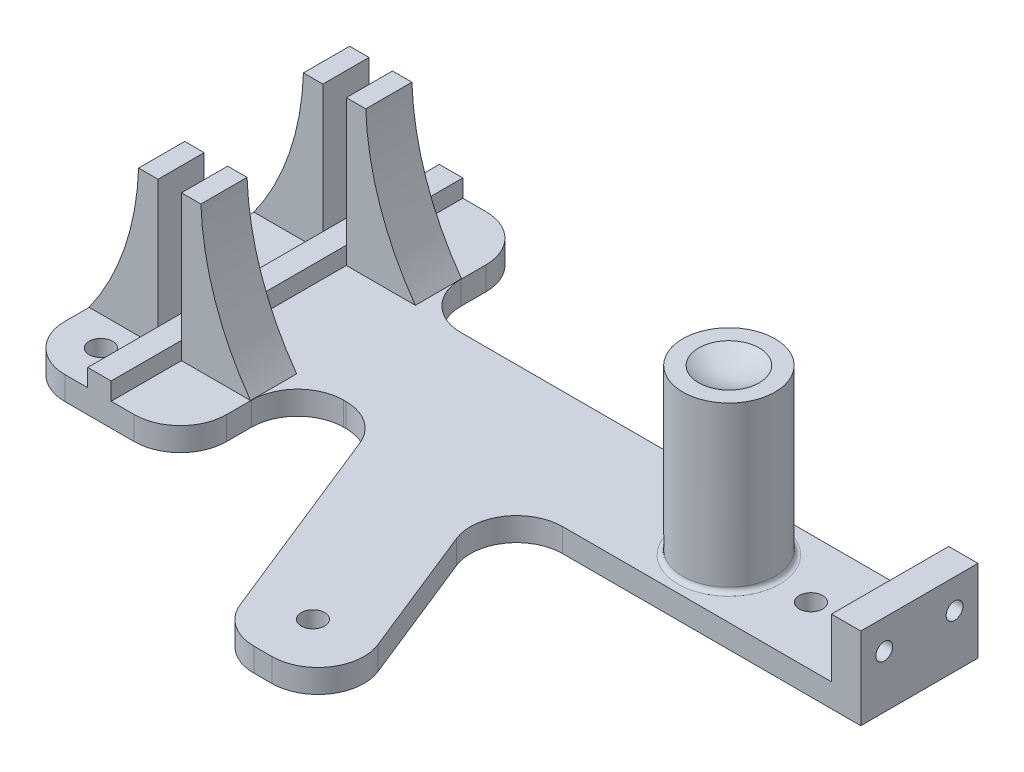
from build123d import *

# Parameters (mm, degrees)
BOSS_EXTRUDE1_DEPTH       = 5.08
BOSS_EXTRUDE2_DEPTH       = 10
SKETCH3_R                 = 10
BOSS_EXTRUDE3_DEPTH       = 35.56
FILLET1_R                 = 1
SKETCH9_W                 = 6.35
SKETCH9_H                 = 25.4
BOSS_EXTRUDE6_DEPTH       = 12.7
F_6_CLEARANCE_HOLE1_D     = 3.6576
F_6_CLEARANCE_HOLE1_DEPTH = 6.35
BOSS_EXTRUDE7_DEPTH       = 5.08
FILLET4_R                 = 10
FILLET5_R                 = 10
CUT_EXTRUDE1_REACH        = 156.709
SKETCH18_R                = 2.54
SKETCH21_W                = 5.08
SKETCH21_H                = 76.2
BOSS_EXTRUDE8_DEPTH       = 3.81
SKETCH22_W                = 9.525
SKETCH22_H                = 25.4
BOSS_EXTRUDE9_DEPTH       = 17.78
F_6_CLEARANCE_HOLE2_D     = 3.6576
F_6_CLEARANCE_HOLE2_DEPTH = 9.525
SKETCH25_W                = 9.525
SKETCH25_H                = 25.4
CUT_EXTRUDE2_DEPTH        = 12.7


with BuildPart() as part:
    # Sketch1 → Boss-Extrude1 (new body)
    with BuildSketch(Plane(origin=(0, 0, 0), x_dir=(1, 0, 0), z_dir=(0, 1, 0))):
        with BuildLine():
            Line((20.08, 28.1), (20.08, 22.7))
            ThreePointArc((20.08, 22.7), (23.008932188, 15.628932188), (30.08, 12.7))
            Line((30.08, 12.7), (126.24, 12.7))
            Line((126.24, 12.7), (132.59, 12.7))
            Line((132.59, 12.7), (132.59, 0))
            Line((132.59, 0), (132.59, -12.7))
            Line((132.59, -12.7), (126.24, -12.7))
            Line((126.24, -12.7), (30.08, -12.7))
            ThreePointArc((30.08, -12.7), (23.008932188, -15.628932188), (20.08, -22.7))
            Line((20.08, -22.7), (20.08, -28.1))
            ThreePointArc((20.08, -28.1), (17.151067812, -35.171067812), (10.08, -38.1))
            Line((10.08, -38.1), (-4.92, -38.1))
            ThreePointArc((-4.92, -38.1), (-11.991067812, -35.171067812), (-14.92, -28.1))
            Line((-14.92, -28.1), (-14.92, 28.1))
            ThreePointArc((-14.92, 28.1), (-11.991067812, 35.171067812), (-4.92, 38.1))
            Line((-4.92, 38.1), (10.08, 38.1))
            ThreePointArc((10.08, 38.1), (17.151067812, 35.171067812), (20.08, 28.1))
        make_face()
    extrude(amount=-BOSS_EXTRUDE1_DEPTH)

    # Sketch2 → Boss-Extrude2 (add)
    with BuildSketch(Plane.XY.offset(22.86)):
        with BuildLine():
            Line((0, 0), (-14.953299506, 0))
            ThreePointArc((-14.953299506, 0), (-7.255141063, 14.95657571), (-4.209502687, 31.5))
            Line((-4.209502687, 31.5), (0, 31.5))
            Line((0, 31.5), (0, 0))
        make_face()
        with BuildLine():
            Line((5.08, 0), (20.033299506, 0))
            ThreePointArc((20.033299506, 0), (12.335141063, 14.95657571), (9.289502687, 31.5))
            Line((9.289502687, 31.5), (5.08, 31.5))
            Line((5.08, 31.5), (5.08, 0))
        make_face()
    boss_extrude2 = extrude(amount=-BOSS_EXTRUDE2_DEPTH)

    # Mirror1: Boss-Extrude2 across plane
    add(boss_extrude2.mirror(Plane.XY))

    # Sketch3 → Boss-Extrude3 (add)
    with BuildSketch(Plane(origin=(0, 0, 0), x_dir=(1, 0, 0), z_dir=(0, 1, 0))):
        with Locations(Location((100.84, 0, 0), (0, 0, 90))):
            Circle(SKETCH3_R)
    extrude(amount=BOSS_EXTRUDE3_DEPTH)

    # Fillet1
    fillet1_edges = [part.edges().sort_by_distance(p)[0] for p in [
        (100.84, 0, 10),
    ]]
    fillet(fillet1_edges, radius=FILLET1_R)

    # Sketch4 → Cut-Revolve1 (revolve, cut)
    with BuildSketch(Plane.XY, mode=Mode.PRIVATE) as cut_revolve1_sk:
        with BuildLine():
            Line((100.84, 35.56), (107.399510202, 35.56))
            ThreePointArc((107.399510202, 35.56), (104.235709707, 34.2471456), (100.84, 33.797283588))
            Line((100.84, 33.797283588), (100.84, 35.56))
        make_face()
    revolve(cut_revolve1_sk.sketch.rotate(Axis((100.84, 35.56, 0), (0, -1, 0)), 90), axis=Axis((100.84, 35.56, 0), (0, -1, 0)), mode=Mode.SUBTRACT)

    # Sketch9 → Boss-Extrude6 (add)
    with BuildSketch(Plane(origin=(0, 0, 0), x_dir=(1, 0, 0), z_dir=(0, 1, 0))):
        with Locations((129.415, 0)):
            Rectangle(SKETCH9_W, SKETCH9_H)
    extrude(amount=BOSS_EXTRUDE6_DEPTH)

    # 6 Clearance Hole1
    with Locations(Plane(origin=(132.59, 0, 0), x_dir=(0, 0, -1), z_dir=(1, 0, 0))):
        with Locations((7.62, 6.35), (-7.62, 6.35)):
            Hole(F_6_CLEARANCE_HOLE1_D / 2, depth=F_6_CLEARANCE_HOLE1_DEPTH)

    # Sketch17 → Boss-Extrude7 (add)
    with BuildSketch(Plane(origin=(0, 0, 0), x_dir=(1, 0, 0), z_dir=(0, 1, 0))):
        with BuildLine():
            Line((37.34, -12.7), (57.230452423, -62.301920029))
            ThreePointArc((57.230452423, -62.301920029), (60.909296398, -66.863091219), (66.512010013, -68.58))
            Line((66.512010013, -68.58), (70.36390259, -68.58))
            ThreePointArc((70.36390259, -68.58), (78.646993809, -64.182713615), (79.64546018, -54.858079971))
            Line((79.64546018, -54.858079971), (62.74, -12.7))
            Line((62.74, -12.7), (37.34, -12.7))
        make_face()
    extrude(amount=-BOSS_EXTRUDE7_DEPTH)

    # Fillet4
    fillet4_edges = [part.edges().sort_by_distance(p)[0] for p in [
        (62.74, -2.54, 12.7),
    ]]
    fillet(fillet4_edges, radius=FILLET4_R)

    # Fillet5
    fillet5_edges = [part.edges().sort_by_distance(p)[0] for p in [
        (37.34, -2.54, 12.7),
    ]]
    fillet(fillet5_edges, radius=FILLET5_R)

    # Sketch18 → Cut-Extrude1 (cut, up to next)
    with BuildSketch(Plane.XZ.offset(5.08), mode=Mode.PRIVATE) as cut_extrude1_sk1:
        with Locations(Location((-6.03, 29.21, 0), (0, 0, 270))):
            Circle(SKETCH18_R)
    cut_extrude1_tool1 = extrude(cut_extrude1_sk1.sketch, amount=-CUT_EXTRUDE1_REACH, mode=Mode.PRIVATE) & part.part
    # Sketch18 → Cut-Extrude1 (cut, up to next)
    with BuildSketch(Plane.XZ.offset(5.08), mode=Mode.PRIVATE) as cut_extrude1_sk2:
        with Locations(Location((-6.03, -29.21, 0), (0, 0, 90))):
            Circle(SKETCH18_R)
    cut_extrude1_tool2 = extrude(cut_extrude1_sk2.sketch, amount=-CUT_EXTRUDE1_REACH, mode=Mode.PRIVATE) & part.part
    # Sketch18 → Cut-Extrude1 (cut, up to next)
    with BuildSketch(Plane.XZ.offset(5.08), mode=Mode.PRIVATE) as cut_extrude1_sk3:
        with Locations(Location((67.864523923, 57.15, 0), (0, 0, 270))):
            Circle(SKETCH18_R)
    cut_extrude1_tool3 = extrude(cut_extrude1_sk3.sketch, amount=-CUT_EXTRUDE1_REACH, mode=Mode.PRIVATE) & part.part
    # Sketch18 → Cut-Extrude1 (cut, up to next)
    with BuildSketch(Plane.XZ.offset(5.08), mode=Mode.PRIVATE) as cut_extrude1_sk4:
        with Locations(Location((118.62, 0, 0), (0, 0, 270))):
            Circle(SKETCH18_R)
    cut_extrude1_tool4 = extrude(cut_extrude1_sk4.sketch, amount=-CUT_EXTRUDE1_REACH, mode=Mode.PRIVATE) & part.part
    add(cut_extrude1_tool1.solids().sort_by_distance((-6.03, -5.08, 29.21))[0], mode=Mode.SUBTRACT)
    add(cut_extrude1_tool2.solids().sort_by_distance((-6.03, -5.08, -29.21))[0], mode=Mode.SUBTRACT)
    add(cut_extrude1_tool3.solids().sort_by_distance((67.864524, -5.08, 57.15))[0], mode=Mode.SUBTRACT)
    add(cut_extrude1_tool4.solids().sort_by_distance((118.62, -5.08, 0))[0], mode=Mode.SUBTRACT)

    # Sketch21 → Boss-Extrude8 (add)
    with BuildSketch(Plane(origin=(0, 0, 0), x_dir=(1, 0, 0), z_dir=(0, 1, 0))):
        with Locations((2.54, 0)):
            Rectangle(SKETCH21_W, SKETCH21_H)
    extrude(amount=BOSS_EXTRUDE8_DEPTH)

    # Sketch22 → Boss-Extrude9 (add, through all)
    with BuildSketch(Plane(origin=(0, 12.7, 0), x_dir=(1, 0, 0), z_dir=(0, 1, 0))):
        with Locations((137.3525, 0)):
            Rectangle(SKETCH22_W, SKETCH22_H)
    extrude(amount=-BOSS_EXTRUDE9_DEPTH)

    # 6 Clearance Hole2
    with Locations(Plane.ZY.offset(-132.59)):
        with Locations((7.62, 6.35), (-7.62, 6.35)):
            Hole(F_6_CLEARANCE_HOLE2_D / 2, depth=F_6_CLEARANCE_HOLE2_DEPTH)

    # Sketch25 → Cut-Extrude2 (cut)
    with BuildSketch(Plane(origin=(0, 12.7, 0), x_dir=(1, 0, 0), z_dir=(0, 1, 0))):
        with Locations((131.0025, 0)):
            Rectangle(SKETCH25_W, SKETCH25_H)
    extrude(amount=-CUT_EXTRUDE2_DEPTH, mode=Mode.SUBTRACT)


solid = part.part
